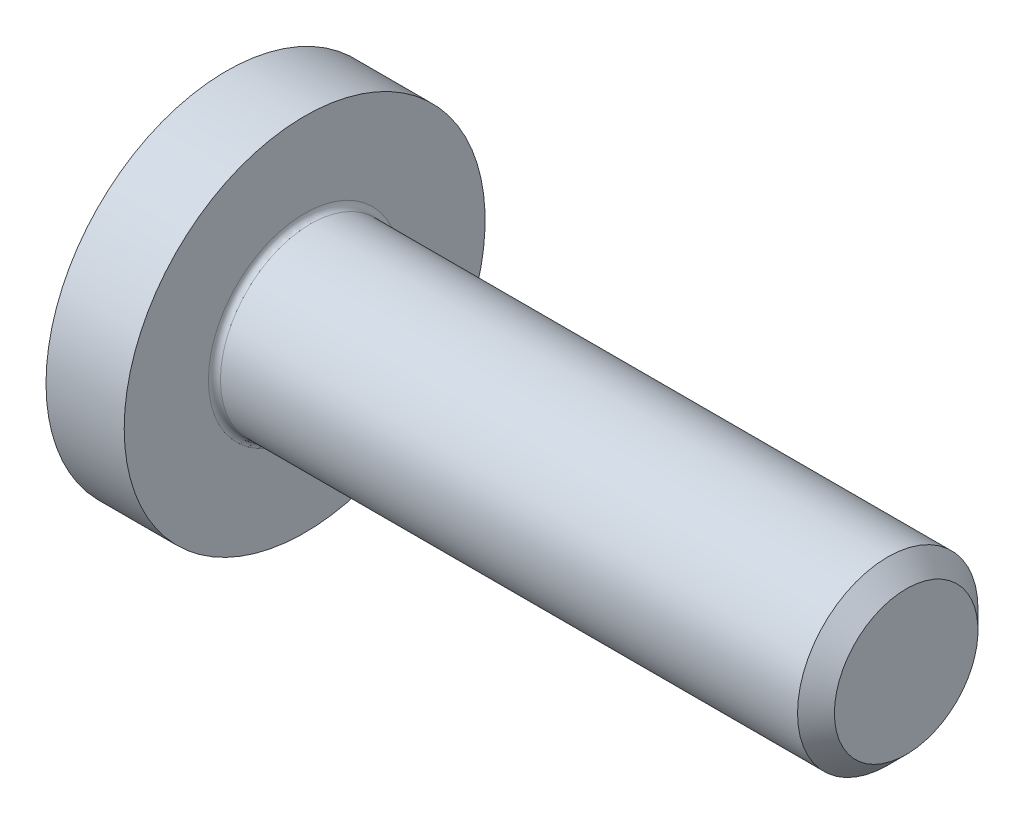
from build123d import *

# Parameters (mm, degrees)
EXTRUDE1_DEPTH = 2


with BuildPart() as part:
    # Sketch1 → Revolve1 (revolve)
    with BuildSketch(Plane.XY, mode=Mode.PRIVATE) as revolve1_sk:
        with BuildLine():
            Line((-1.3, 0), (-1.3, 3))
            Line((-1.3, 3), (0, 3))
            Line((0, 3), (0, 1.6))
            ThreePointArc((0, 1.6), (0.029289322, 1.529289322), (0.1, 1.5))
            Line((0.1, 1.5), (9.6935, 1.5))
            Line((9.6935, 1.5), (10, 1.1935))
            Line((10, 1.1935), (10, 0))
            Line((10, 0), (-1.3, 0))
        make_face()
    revolve(revolve1_sk.sketch.rotate(Axis((10, 0, 0), (-1, 0, 0)), 270), axis=Axis((10, 0, 0), (-1, 0, 0)))

    # Sketch2 → Cut-Revolve1 (revolve, cut)
    with BuildSketch(Plane.XY, mode=Mode.PRIVATE) as cut_revolve1_sk:
        Polygon((-1.3, 0), (-1.3, 0.75), (0.7, 0.75), (1.133012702, 0), align=None)
    revolve(cut_revolve1_sk.sketch.rotate(Axis((1.133012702, 0, 0), (-1, 0, 0)), 270), axis=Axis((1.133012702, 0, 0), (-1, 0, 0)), mode=Mode.SUBTRACT)

    # Sketch3 → Extrude1 (cut)
    with BuildSketch(Plane(origin=(-1.3, 0, 0), x_dir=(0, 0, -1), z_dir=(1, 0, 0))):
        Polygon((-0.75, 0.433012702), (-0.75, -0.433012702), (0, -0.866025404), (0.75, -0.433012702), (0.75, 0.433012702), (0, 0.866025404), align=None)
    extrude(amount=EXTRUDE1_DEPTH, mode=Mode.SUBTRACT)


solid = part.part
